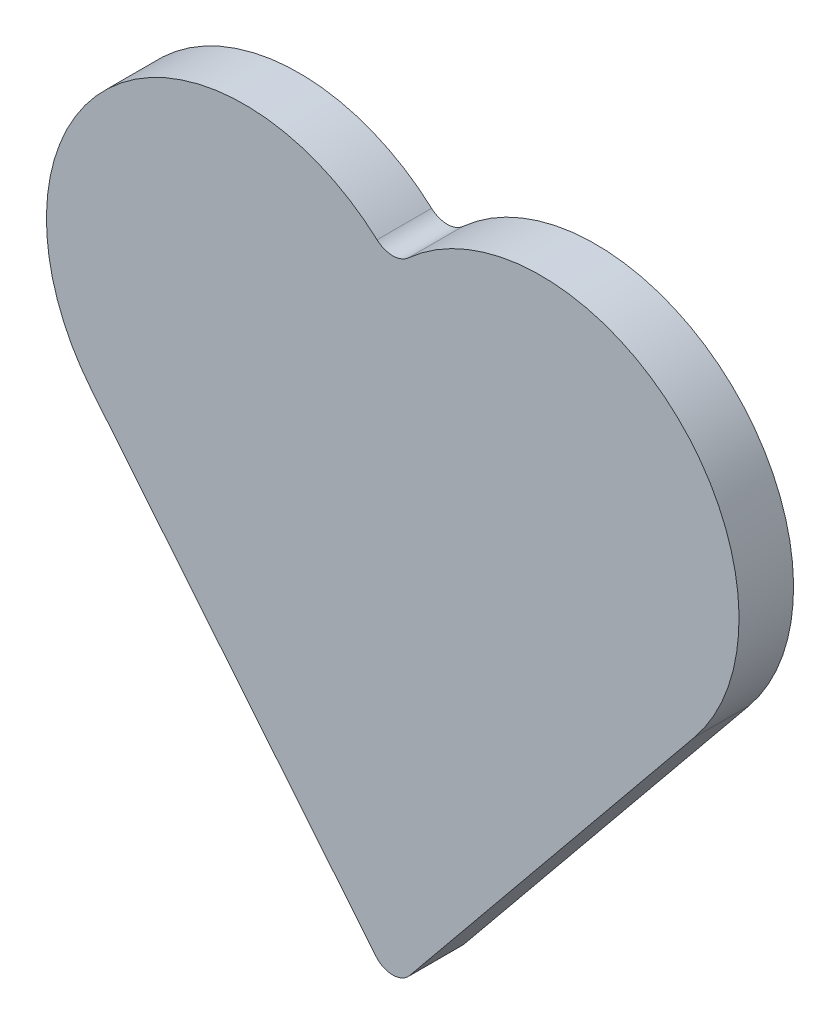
from build123d import *

# Parameters (mm, degrees)
SKETCH1_R           = 3.630738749
BOSS_EXTRUDE1_DEPTH = 1
FILLET1_R           = 0.4


with BuildPart() as part:
    # Sketch1 → Boss-Extrude1 (new body)
    with BuildSketch(Plane.XY):
        with BuildLine():
            ThreePointArc((0, -2.40580176), (-2.790890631, -3.630032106), (-5.531313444, -2.296655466))
            Line((-5.531313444, -2.296655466), (0, -9.069261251))
            Line((0, -9.069261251), (5.531313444, -2.296655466))
            ThreePointArc((5.531313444, -2.296655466), (2.790890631, -3.630032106), (0, -2.40580176))
        make_face()
        with Locations((2.719261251, 0)):
            Circle(SKETCH1_R)
        with Locations((-2.719261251, 0)):
            Circle(SKETCH1_R)
        with Locations((-2.719261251, 0)):
            Circle(SKETCH1_R)
        with Locations((2.719261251, 0)):
            Circle(SKETCH1_R)
        with Locations((-2.719261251, 0)):
            Circle(SKETCH1_R)
        with Locations((2.719261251, 0)):
            Circle(SKETCH1_R)
        with BuildLine():
            ThreePointArc((0.287165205, 2.695769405), (0, 2.585374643), (-0.287165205, 2.695769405))
            ThreePointArc((-0.287165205, 2.695769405), (-0.139505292, 2.554823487), (0, 2.40580176))
            ThreePointArc((0, 2.40580176), (0.139505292, 2.554823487), (0.287165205, 2.695769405))
        make_face()
    extrude(amount=BOSS_EXTRUDE1_DEPTH)

    # Fillet1
    fillet1_edges = [part.edges().sort_by_distance(p)[0] for p in [
        (0, -9.069261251, 0.5),
    ]]
    fillet(fillet1_edges, radius=FILLET1_R)


solid = part.part
